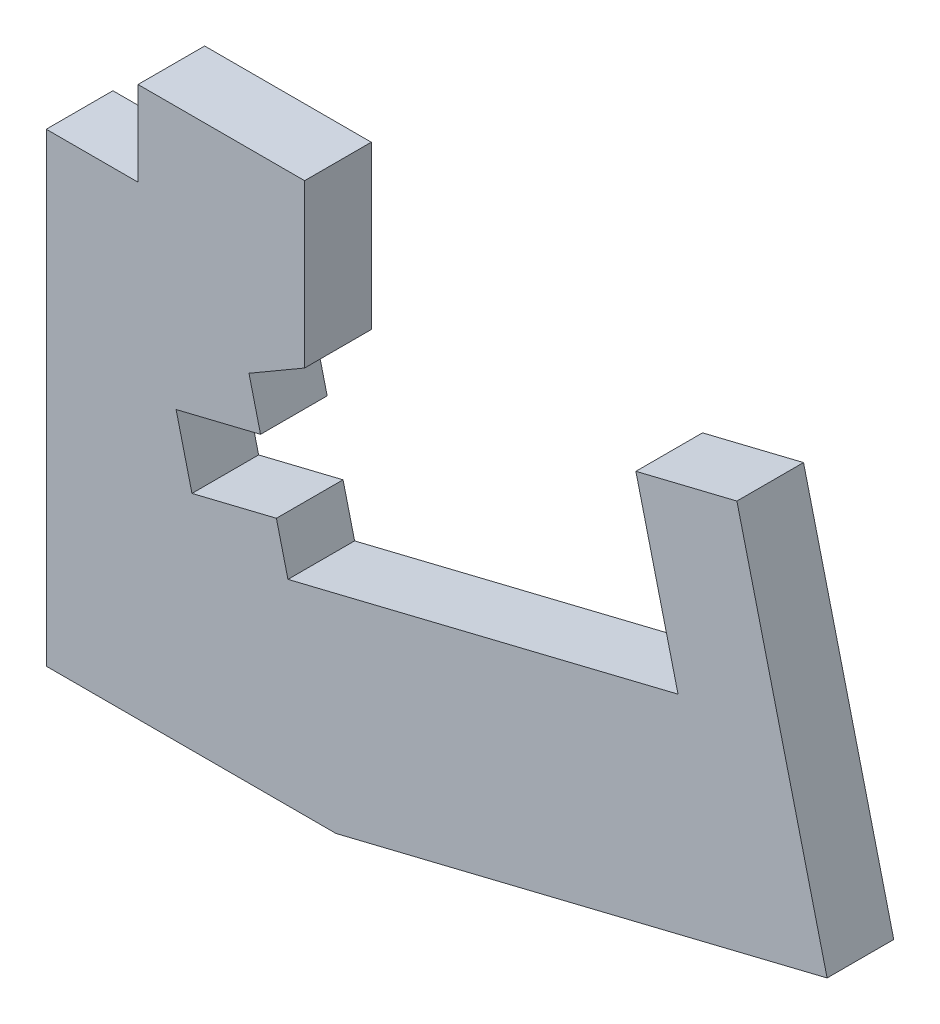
ISO-10303-21;
HEADER;
FILE_DESCRIPTION(('STEP AP214'),'2;1');
FILE_NAME('part.step','',(''),(''),'','','');
FILE_SCHEMA(('AUTOMOTIVE_DESIGN { 1 0 10303 214 1 1 1 1 }'));
ENDSEC;
DATA;
#1=APPLICATION_CONTEXT('core data for automotive mechanical design processes');
#2=APPLICATION_PROTOCOL_DEFINITION('international standard','automotive_design',2000,#1);
#3=PRODUCT_CONTEXT('',#1,'mechanical');
#4=PRODUCT('Part','Part','',(#3));
#5=PRODUCT_RELATED_PRODUCT_CATEGORY('part','',(#4));
#6=PRODUCT_DEFINITION_FORMATION('','',#4);
#7=PRODUCT_DEFINITION_CONTEXT('part definition',#1,'design');
#8=PRODUCT_DEFINITION('design','',#6,#7);
#9=PRODUCT_DEFINITION_SHAPE('','',#8);
#10=(LENGTH_UNIT() NAMED_UNIT(*) SI_UNIT(.MILLI.,.METRE.));
#11=(NAMED_UNIT(*) PLANE_ANGLE_UNIT() SI_UNIT($,.RADIAN.));
#12=(NAMED_UNIT(*) SI_UNIT($,.STERADIAN.) SOLID_ANGLE_UNIT());
#13=UNCERTAINTY_MEASURE_WITH_UNIT(LENGTH_MEASURE(1.E-05),#10,'distance_accuracy_value','');
#14=(GEOMETRIC_REPRESENTATION_CONTEXT(3) GLOBAL_UNCERTAINTY_ASSIGNED_CONTEXT((#13)) GLOBAL_UNIT_ASSIGNED_CONTEXT((#10,
#11,#12)) REPRESENTATION_CONTEXT('',''));
#15=CARTESIAN_POINT('',(0.,0.,0.));
#16=DIRECTION('',(0.,0.,1.));
#17=DIRECTION('',(1.,0.,0.));
#18=AXIS2_PLACEMENT_3D('',#15,#16,#17);
#19=CARTESIAN_POINT('',(8.0438013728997,40.764501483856,5.842));
#20=DIRECTION('',(0.,-1.,0.));
#21=DIRECTION('',(0.,0.,-1.));
#22=AXIS2_PLACEMENT_3D('',#19,#20,#21);
#23=PLANE('',#22);
#24=DIRECTION('',(-1.,0.,0.));
#25=VECTOR('',#24,1.);
#26=CARTESIAN_POINT('',(8.0438013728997,40.764501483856,0.));
#27=LINE('',#26,#25);
#28=CARTESIAN_POINT('',(8.0438013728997,40.764501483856,0.));
#29=VERTEX_POINT('',#28);
#30=CARTESIAN_POINT('',(0.,40.764501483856,0.));
#31=VERTEX_POINT('',#30);
#32=EDGE_CURVE('E153',#29,#31,#27,.T.);
#33=ORIENTED_EDGE('',*,*,#32,.T.);
#34=DIRECTION('',(0.,0.,-1.));
#35=VECTOR('',#34,1.);
#36=CARTESIAN_POINT('',(0.,40.764501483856,5.842));
#37=LINE('',#36,#35);
#38=CARTESIAN_POINT('',(0.,40.764501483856,5.842));
#39=VERTEX_POINT('',#38);
#40=EDGE_CURVE('E11',#39,#31,#37,.T.);
#41=ORIENTED_EDGE('',*,*,#40,.F.);
#42=DIRECTION('',(-1.,0.,0.));
#43=VECTOR('',#42,1.);
#44=CARTESIAN_POINT('',(8.0438013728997,40.764501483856,5.842));
#45=LINE('',#44,#43);
#46=CARTESIAN_POINT('',(8.0438013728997,40.764501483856,5.842));
#47=VERTEX_POINT('',#46);
#48=EDGE_CURVE('E198',#47,#39,#45,.T.);
#49=ORIENTED_EDGE('',*,*,#48,.F.);
#50=DIRECTION('',(0.,0.,-1.));
#51=VECTOR('',#50,1.);
#52=CARTESIAN_POINT('',(8.0438013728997,40.764501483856,5.842));
#53=LINE('',#52,#51);
#54=EDGE_CURVE('E166',#47,#29,#53,.T.);
#55=ORIENTED_EDGE('',*,*,#54,.T.);
#56=EDGE_LOOP('',(#33,#41,#49,#55));
#57=FACE_BOUND('',#56,.T.);
#58=ADVANCED_FACE('F31',(#57),#23,.F.);
#59=CARTESIAN_POINT('',(0.,40.764501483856,5.842));
#60=DIRECTION('',(1.,0.,0.));
#61=DIRECTION('',(0.,0.,-1.));
#62=AXIS2_PLACEMENT_3D('',#59,#60,#61);
#63=PLANE('',#62);
#64=DIRECTION('',(0.,-1.,0.));
#65=VECTOR('',#64,1.);
#66=CARTESIAN_POINT('',(0.,40.764501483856,0.));
#67=LINE('',#66,#65);
#68=CARTESIAN_POINT('',(0.,0.,0.));
#69=VERTEX_POINT('',#68);
#70=EDGE_CURVE('E149',#31,#69,#67,.T.);
#71=ORIENTED_EDGE('',*,*,#70,.T.);
#72=DIRECTION('',(0.,0.,-1.));
#73=VECTOR('',#72,1.);
#74=CARTESIAN_POINT('',(0.,0.,5.842));
#75=LINE('',#74,#73);
#76=CARTESIAN_POINT('',(0.,0.,5.842));
#77=VERTEX_POINT('',#76);
#78=EDGE_CURVE('E38',#77,#69,#75,.T.);
#79=ORIENTED_EDGE('',*,*,#78,.F.);
#80=DIRECTION('',(0.,-1.,0.));
#81=VECTOR('',#80,1.);
#82=CARTESIAN_POINT('',(0.,40.764501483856,5.842));
#83=LINE('',#82,#81);
#84=EDGE_CURVE('E162',#39,#77,#83,.T.);
#85=ORIENTED_EDGE('',*,*,#84,.F.);
#86=ORIENTED_EDGE('',*,*,#40,.T.);
#87=EDGE_LOOP('',(#71,#79,#85,#86));
#88=FACE_BOUND('',#87,.T.);
#89=ADVANCED_FACE('F161',(#88),#63,.F.);
#90=CARTESIAN_POINT('',(0.,0.,5.842));
#91=DIRECTION('',(0.,1.,0.));
#92=DIRECTION('',(0.,0.,1.));
#93=AXIS2_PLACEMENT_3D('',#90,#91,#92);
#94=PLANE('',#93);
#95=DIRECTION('',(1.,0.,0.));
#96=VECTOR('',#95,1.);
#97=CARTESIAN_POINT('',(0.,0.,0.));
#98=LINE('',#97,#96);
#99=CARTESIAN_POINT('',(25.4,0.,0.));
#100=VERTEX_POINT('',#99);
#101=EDGE_CURVE('E155',#69,#100,#98,.T.);
#102=ORIENTED_EDGE('',*,*,#101,.T.);
#103=DIRECTION('',(0.,0.,-1.));
#104=VECTOR('',#103,1.);
#105=CARTESIAN_POINT('',(25.4,0.,5.842));
#106=LINE('',#105,#104);
#107=CARTESIAN_POINT('',(25.4,0.,5.842));
#108=VERTEX_POINT('',#107);
#109=EDGE_CURVE('E269',#108,#100,#106,.T.);
#110=ORIENTED_EDGE('',*,*,#109,.F.);
#111=DIRECTION('',(1.,0.,0.));
#112=VECTOR('',#111,1.);
#113=CARTESIAN_POINT('',(0.,0.,5.842));
#114=LINE('',#113,#112);
#115=EDGE_CURVE('E201',#77,#108,#114,.T.);
#116=ORIENTED_EDGE('',*,*,#115,.F.);
#117=ORIENTED_EDGE('',*,*,#78,.T.);
#118=EDGE_LOOP('',(#102,#110,#116,#117));
#119=FACE_BOUND('',#118,.T.);
#120=ADVANCED_FACE('F273',(#119),#94,.F.);
#121=CARTESIAN_POINT('',(25.4,0.,5.842));
#122=DIRECTION('',(-0.238109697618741,0.971238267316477,0.));
#123=DIRECTION('',(-0.971238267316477,-0.238109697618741,0.));
#124=AXIS2_PLACEMENT_3D('',#121,#122,#123);
#125=PLANE('',#124);
#126=DIRECTION('',(0.971238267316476,0.238109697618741,0.));
#127=VECTOR('',#126,1.);
#128=CARTESIAN_POINT('',(25.4,0.,0.));
#129=LINE('',#128,#127);
#130=CARTESIAN_POINT('',(68.446907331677,10.5534207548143,0.));
#131=VERTEX_POINT('',#130);
#132=EDGE_CURVE('E170',#100,#131,#129,.T.);
#133=ORIENTED_EDGE('',*,*,#132,.T.);
#134=DIRECTION('',(0.,0.,-1.));
#135=VECTOR('',#134,1.);
#136=CARTESIAN_POINT('',(68.446907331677,10.5534207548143,5.842));
#137=LINE('',#136,#135);
#138=CARTESIAN_POINT('',(68.446907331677,10.5534207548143,5.842));
#139=VERTEX_POINT('',#138);
#140=EDGE_CURVE('E266',#139,#131,#137,.T.);
#141=ORIENTED_EDGE('',*,*,#140,.F.);
#142=DIRECTION('',(0.971238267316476,0.238109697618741,0.));
#143=VECTOR('',#142,1.);
#144=CARTESIAN_POINT('',(25.4,0.,5.842));
#145=LINE('',#144,#143);
#146=EDGE_CURVE('E203',#108,#139,#145,.T.);
#147=ORIENTED_EDGE('',*,*,#146,.F.);
#148=ORIENTED_EDGE('',*,*,#109,.T.);
#149=EDGE_LOOP('',(#133,#141,#147,#148));
#150=FACE_BOUND('',#149,.T.);
#151=ADVANCED_FACE('F281',(#150),#125,.F.);
#152=CARTESIAN_POINT('',(68.446907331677,10.5534207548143,5.842));
#153=DIRECTION('',(-0.971238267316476,-0.238109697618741,0.));
#154=DIRECTION('',(0.238109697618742,-0.971238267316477,0.));
#155=AXIS2_PLACEMENT_3D('',#152,#153,#154);
#156=PLANE('',#155);
#157=DIRECTION('',(-0.238109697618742,0.971238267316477,0.));
#158=VECTOR('',#157,1.);
#159=CARTESIAN_POINT('',(68.446907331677,10.5534207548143,0.));
#160=LINE('',#159,#158);
#161=CARTESIAN_POINT('',(60.5393817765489,42.8078459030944,0.));
#162=VERTEX_POINT('',#161);
#163=EDGE_CURVE('E172',#131,#162,#160,.T.);
#164=ORIENTED_EDGE('',*,*,#163,.T.);
#165=DIRECTION('',(0.,0.,-1.));
#166=VECTOR('',#165,1.);
#167=CARTESIAN_POINT('',(60.5393817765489,42.8078459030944,5.842));
#168=LINE('',#167,#166);
#169=CARTESIAN_POINT('',(60.5393817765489,42.8078459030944,5.842));
#170=VERTEX_POINT('',#169);
#171=EDGE_CURVE('E263',#170,#162,#168,.T.);
#172=ORIENTED_EDGE('',*,*,#171,.F.);
#173=DIRECTION('',(-0.238109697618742,0.971238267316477,0.));
#174=VECTOR('',#173,1.);
#175=CARTESIAN_POINT('',(68.446907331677,10.5534207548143,5.842));
#176=LINE('',#175,#174);
#177=EDGE_CURVE('E205',#139,#170,#176,.T.);
#178=ORIENTED_EDGE('',*,*,#177,.F.);
#179=ORIENTED_EDGE('',*,*,#140,.T.);
#180=EDGE_LOOP('',(#164,#172,#178,#179));
#181=FACE_BOUND('',#180,.T.);
#182=ADVANCED_FACE('F284',(#181),#156,.F.);
#183=CARTESIAN_POINT('',(60.5393817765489,42.8078459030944,5.842));
#184=DIRECTION('',(0.238109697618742,-0.971238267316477,0.));
#185=DIRECTION('',(0.971238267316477,0.238109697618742,0.));
#186=AXIS2_PLACEMENT_3D('',#183,#184,#185);
#187=PLANE('',#186);
#188=DIRECTION('',(-0.971238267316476,-0.238109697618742,0.));
#189=VECTOR('',#188,1.);
#190=CARTESIAN_POINT('',(60.5393817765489,42.8078459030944,0.));
#191=LINE('',#190,#189);
#192=CARTESIAN_POINT('',(51.6843349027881,40.6369341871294,0.));
#193=VERTEX_POINT('',#192);
#194=EDGE_CURVE('E174',#162,#193,#191,.T.);
#195=ORIENTED_EDGE('',*,*,#194,.T.);
#196=DIRECTION('',(0.,0.,-1.));
#197=VECTOR('',#196,1.);
#198=CARTESIAN_POINT('',(51.6843349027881,40.6369341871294,5.842));
#199=LINE('',#198,#197);
#200=CARTESIAN_POINT('',(51.6843349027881,40.6369341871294,5.842));
#201=VERTEX_POINT('',#200);
#202=EDGE_CURVE('E260',#201,#193,#199,.T.);
#203=ORIENTED_EDGE('',*,*,#202,.F.);
#204=DIRECTION('',(-0.971238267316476,-0.238109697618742,0.));
#205=VECTOR('',#204,1.);
#206=CARTESIAN_POINT('',(60.5393817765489,42.8078459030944,5.842));
#207=LINE('',#206,#205);
#208=EDGE_CURVE('E207',#170,#201,#207,.T.);
#209=ORIENTED_EDGE('',*,*,#208,.F.);
#210=ORIENTED_EDGE('',*,*,#171,.T.);
#211=EDGE_LOOP('',(#195,#203,#209,#210));
#212=FACE_BOUND('',#211,.T.);
#213=ADVANCED_FACE('F289',(#212),#187,.F.);
#214=CARTESIAN_POINT('',(51.6843349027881,40.6369341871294,5.842));
#215=DIRECTION('',(0.971238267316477,0.238109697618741,0.));
#216=DIRECTION('',(-0.238109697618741,0.971238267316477,0.));
#217=AXIS2_PLACEMENT_3D('',#214,#215,#216);
#218=PLANE('',#217);
#219=DIRECTION('',(0.238109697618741,-0.971238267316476,0.));
#220=VECTOR('',#219,1.);
#221=CARTESIAN_POINT('',(51.6843349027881,40.6369341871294,0.));
#222=LINE('',#221,#220);
#223=CARTESIAN_POINT('',(55.3787556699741,25.5675654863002,0.));
#224=VERTEX_POINT('',#223);
#225=EDGE_CURVE('E176',#193,#224,#222,.T.);
#226=ORIENTED_EDGE('',*,*,#225,.T.);
#227=DIRECTION('',(0.,0.,-1.));
#228=VECTOR('',#227,1.);
#229=CARTESIAN_POINT('',(55.3787556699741,25.5675654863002,5.842));
#230=LINE('',#229,#228);
#231=CARTESIAN_POINT('',(55.3787556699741,25.5675654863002,5.842));
#232=VERTEX_POINT('',#231);
#233=EDGE_CURVE('E257',#232,#224,#230,.T.);
#234=ORIENTED_EDGE('',*,*,#233,.F.);
#235=DIRECTION('',(0.238109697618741,-0.971238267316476,0.));
#236=VECTOR('',#235,1.);
#237=CARTESIAN_POINT('',(51.6843349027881,40.6369341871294,5.842));
#238=LINE('',#237,#236);
#239=EDGE_CURVE('E209',#201,#232,#238,.T.);
#240=ORIENTED_EDGE('',*,*,#239,.F.);
#241=ORIENTED_EDGE('',*,*,#202,.T.);
#242=EDGE_LOOP('',(#226,#234,#240,#241));
#243=FACE_BOUND('',#242,.T.);
#244=ADVANCED_FACE('F295',(#243),#218,.F.);
#245=CARTESIAN_POINT('',(21.186895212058,17.185056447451,5.842));
#246=DIRECTION('',(0.238109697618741,-0.971238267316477,0.));
#247=DIRECTION('',(0.971238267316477,0.238109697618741,0.));
#248=AXIS2_PLACEMENT_3D('',#245,#246,#247);
#249=PLANE('',#248);
#250=DIRECTION('',(-0.971238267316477,-0.238109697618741,0.));
#251=VECTOR('',#250,1.);
#252=CARTESIAN_POINT('',(21.186895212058,17.185056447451,0.));
#253=LINE('',#252,#251);
#254=CARTESIAN_POINT('',(21.186895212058,17.185056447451,0.));
#255=VERTEX_POINT('',#254);
#256=EDGE_CURVE('E178',#224,#255,#253,.T.);
#257=ORIENTED_EDGE('',*,*,#256,.T.);
#258=DIRECTION('',(0.,0.,-1.));
#259=VECTOR('',#258,1.);
#260=CARTESIAN_POINT('',(21.186895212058,17.185056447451,5.842));
#261=LINE('',#260,#259);
#262=CARTESIAN_POINT('',(21.186895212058,17.185056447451,5.842));
#263=VERTEX_POINT('',#262);
#264=EDGE_CURVE('E254',#263,#255,#261,.T.);
#265=ORIENTED_EDGE('',*,*,#264,.F.);
#266=DIRECTION('',(-0.971238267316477,-0.238109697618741,0.));
#267=VECTOR('',#266,1.);
#268=CARTESIAN_POINT('',(21.186895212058,17.185056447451,5.842));
#269=LINE('',#268,#267);
#270=EDGE_CURVE('E211',#232,#263,#269,.T.);
#271=ORIENTED_EDGE('',*,*,#270,.F.);
#272=ORIENTED_EDGE('',*,*,#233,.T.);
#273=EDGE_LOOP('',(#257,#265,#271,#272));
#274=FACE_BOUND('',#273,.T.);
#275=ADVANCED_FACE('F299',(#274),#249,.F.);
#276=CARTESIAN_POINT('',(20.173857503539,21.3171896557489,5.842));
#277=DIRECTION('',(-0.971238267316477,-0.23810969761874,0.));
#278=DIRECTION('',(0.23810969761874,-0.971238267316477,0.));
#279=AXIS2_PLACEMENT_3D('',#276,#277,#278);
#280=PLANE('',#279);
#281=DIRECTION('',(-0.23810969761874,0.971238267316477,0.));
#282=VECTOR('',#281,1.);
#283=CARTESIAN_POINT('',(20.173857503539,21.3171896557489,0.));
#284=LINE('',#283,#282);
#285=CARTESIAN_POINT('',(20.173857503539,21.3171896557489,0.));
#286=VERTEX_POINT('',#285);
#287=EDGE_CURVE('E180',#255,#286,#284,.T.);
#288=ORIENTED_EDGE('',*,*,#287,.T.);
#289=DIRECTION('',(0.,0.,-1.));
#290=VECTOR('',#289,1.);
#291=CARTESIAN_POINT('',(20.173857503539,21.3171896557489,5.842));
#292=LINE('',#291,#290);
#293=CARTESIAN_POINT('',(20.173857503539,21.3171896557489,5.842));
#294=VERTEX_POINT('',#293);
#295=EDGE_CURVE('E251',#294,#286,#292,.T.);
#296=ORIENTED_EDGE('',*,*,#295,.F.);
#297=DIRECTION('',(-0.23810969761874,0.971238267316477,0.));
#298=VECTOR('',#297,1.);
#299=CARTESIAN_POINT('',(20.173857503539,21.3171896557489,5.842));
#300=LINE('',#299,#298);
#301=EDGE_CURVE('E213',#263,#294,#300,.T.);
#302=ORIENTED_EDGE('',*,*,#301,.F.);
#303=ORIENTED_EDGE('',*,*,#264,.T.);
#304=EDGE_LOOP('',(#288,#296,#302,#303));
#305=FACE_BOUND('',#304,.T.);
#306=ADVANCED_FACE('F304',(#305),#280,.F.);
#307=CARTESIAN_POINT('',(12.7730219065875,19.5027937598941,5.842));
#308=DIRECTION('',(0.238109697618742,-0.971238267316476,0.));
#309=DIRECTION('',(0.971238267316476,0.238109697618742,0.));
#310=AXIS2_PLACEMENT_3D('',#307,#308,#309);
#311=PLANE('',#310);
#312=DIRECTION('',(-0.971238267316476,-0.238109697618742,0.));
#313=VECTOR('',#312,1.);
#314=CARTESIAN_POINT('',(12.7730219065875,19.5027937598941,0.));
#315=LINE('',#314,#313);
#316=CARTESIAN_POINT('',(12.7730219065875,19.5027937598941,0.));
#317=VERTEX_POINT('',#316);
#318=EDGE_CURVE('E182',#286,#317,#315,.T.);
#319=ORIENTED_EDGE('',*,*,#318,.T.);
#320=DIRECTION('',(0.,0.,-1.));
#321=VECTOR('',#320,1.);
#322=CARTESIAN_POINT('',(12.7730219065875,19.5027937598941,5.842));
#323=LINE('',#322,#321);
#324=CARTESIAN_POINT('',(12.7730219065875,19.5027937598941,5.842));
#325=VERTEX_POINT('',#324);
#326=EDGE_CURVE('E248',#325,#317,#323,.T.);
#327=ORIENTED_EDGE('',*,*,#326,.F.);
#328=DIRECTION('',(-0.971238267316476,-0.238109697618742,0.));
#329=VECTOR('',#328,1.);
#330=CARTESIAN_POINT('',(12.7730219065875,19.5027937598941,5.842));
#331=LINE('',#330,#329);
#332=EDGE_CURVE('E215',#294,#325,#331,.T.);
#333=ORIENTED_EDGE('',*,*,#332,.F.);
#334=ORIENTED_EDGE('',*,*,#295,.T.);
#335=EDGE_LOOP('',(#319,#327,#333,#334));
#336=FACE_BOUND('',#335,.T.);
#337=ADVANCED_FACE('F310',(#336),#311,.F.);
#338=CARTESIAN_POINT('',(11.3819850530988,25.176767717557,5.842));
#339=DIRECTION('',(-0.971238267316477,-0.238109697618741,0.));
#340=DIRECTION('',(0.238109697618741,-0.971238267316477,0.));
#341=AXIS2_PLACEMENT_3D('',#338,#339,#340);
#342=PLANE('',#341);
#343=DIRECTION('',(-0.238109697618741,0.971238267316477,0.));
#344=VECTOR('',#343,1.);
#345=CARTESIAN_POINT('',(11.3819850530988,25.176767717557,0.));
#346=LINE('',#345,#344);
#347=CARTESIAN_POINT('',(11.3819850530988,25.176767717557,0.));
#348=VERTEX_POINT('',#347);
#349=EDGE_CURVE('E184',#317,#348,#346,.T.);
#350=ORIENTED_EDGE('',*,*,#349,.T.);
#351=DIRECTION('',(0.,0.,-1.));
#352=VECTOR('',#351,1.);
#353=CARTESIAN_POINT('',(11.3819850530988,25.176767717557,5.842));
#354=LINE('',#353,#352);
#355=CARTESIAN_POINT('',(11.3819850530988,25.176767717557,5.842));
#356=VERTEX_POINT('',#355);
#357=EDGE_CURVE('E245',#356,#348,#354,.T.);
#358=ORIENTED_EDGE('',*,*,#357,.F.);
#359=DIRECTION('',(-0.238109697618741,0.971238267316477,0.));
#360=VECTOR('',#359,1.);
#361=CARTESIAN_POINT('',(11.3819850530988,25.176767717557,5.842));
#362=LINE('',#361,#360);
#363=EDGE_CURVE('E217',#325,#356,#362,.T.);
#364=ORIENTED_EDGE('',*,*,#363,.F.);
#365=ORIENTED_EDGE('',*,*,#326,.T.);
#366=EDGE_LOOP('',(#350,#358,#364,#365));
#367=FACE_BOUND('',#366,.T.);
#368=ADVANCED_FACE('F314',(#367),#342,.F.);
#369=CARTESIAN_POINT('',(18.7828206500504,26.9911636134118,5.842));
#370=DIRECTION('',(-0.238109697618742,0.971238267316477,0.));
#371=DIRECTION('',(-0.971238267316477,-0.238109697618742,0.));
#372=AXIS2_PLACEMENT_3D('',#369,#370,#371);
#373=PLANE('',#372);
#374=DIRECTION('',(0.971238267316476,0.238109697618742,0.));
#375=VECTOR('',#374,1.);
#376=CARTESIAN_POINT('',(18.7828206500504,26.9911636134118,0.));
#377=LINE('',#376,#375);
#378=CARTESIAN_POINT('',(18.7828206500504,26.9911636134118,0.));
#379=VERTEX_POINT('',#378);
#380=EDGE_CURVE('E186',#348,#379,#377,.T.);
#381=ORIENTED_EDGE('',*,*,#380,.T.);
#382=DIRECTION('',(0.,0.,-1.));
#383=VECTOR('',#382,1.);
#384=CARTESIAN_POINT('',(18.7828206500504,26.9911636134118,5.842));
#385=LINE('',#384,#383);
#386=CARTESIAN_POINT('',(18.7828206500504,26.9911636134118,5.842));
#387=VERTEX_POINT('',#386);
#388=EDGE_CURVE('E242',#387,#379,#385,.T.);
#389=ORIENTED_EDGE('',*,*,#388,.F.);
#390=DIRECTION('',(0.971238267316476,0.238109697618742,0.));
#391=VECTOR('',#390,1.);
#392=CARTESIAN_POINT('',(18.7828206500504,26.9911636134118,5.842));
#393=LINE('',#392,#391);
#394=EDGE_CURVE('E219',#356,#387,#393,.T.);
#395=ORIENTED_EDGE('',*,*,#394,.F.);
#396=ORIENTED_EDGE('',*,*,#357,.T.);
#397=EDGE_LOOP('',(#381,#389,#395,#396));
#398=FACE_BOUND('',#397,.T.);
#399=ADVANCED_FACE('F319',(#398),#373,.F.);
#400=CARTESIAN_POINT('',(17.7697829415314,31.1232968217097,5.842));
#401=DIRECTION('',(-0.971238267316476,-0.238109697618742,0.));
#402=DIRECTION('',(0.238109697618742,-0.971238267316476,0.));
#403=AXIS2_PLACEMENT_3D('',#400,#401,#402);
#404=PLANE('',#403);
#405=DIRECTION('',(-0.238109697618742,0.971238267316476,0.));
#406=VECTOR('',#405,1.);
#407=CARTESIAN_POINT('',(17.7697829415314,31.1232968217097,0.));
#408=LINE('',#407,#406);
#409=CARTESIAN_POINT('',(17.7697829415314,31.1232968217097,0.));
#410=VERTEX_POINT('',#409);
#411=EDGE_CURVE('E188',#379,#410,#408,.T.);
#412=ORIENTED_EDGE('',*,*,#411,.T.);
#413=DIRECTION('',(0.,0.,-1.));
#414=VECTOR('',#413,1.);
#415=CARTESIAN_POINT('',(17.7697829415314,31.1232968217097,5.842));
#416=LINE('',#415,#414);
#417=CARTESIAN_POINT('',(17.7697829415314,31.1232968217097,5.842));
#418=VERTEX_POINT('',#417);
#419=EDGE_CURVE('E239',#418,#410,#416,.T.);
#420=ORIENTED_EDGE('',*,*,#419,.F.);
#421=DIRECTION('',(-0.238109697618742,0.971238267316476,0.));
#422=VECTOR('',#421,1.);
#423=CARTESIAN_POINT('',(17.7697829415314,31.1232968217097,5.842));
#424=LINE('',#423,#422);
#425=EDGE_CURVE('E221',#387,#418,#424,.T.);
#426=ORIENTED_EDGE('',*,*,#425,.F.);
#427=ORIENTED_EDGE('',*,*,#388,.T.);
#428=EDGE_LOOP('',(#412,#420,#426,#427));
#429=FACE_BOUND('',#428,.T.);
#430=ADVANCED_FACE('F325',(#429),#404,.F.);
#431=CARTESIAN_POINT('',(17.7697829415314,31.1232968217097,5.842));
#432=DIRECTION('',(-0.502642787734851,0.864494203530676,0.));
#433=DIRECTION('',(-0.864494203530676,-0.502642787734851,0.));
#434=AXIS2_PLACEMENT_3D('',#431,#432,#433);
#435=PLANE('',#434);
#436=DIRECTION('',(0.864494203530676,0.502642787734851,0.));
#437=VECTOR('',#436,1.);
#438=CARTESIAN_POINT('',(17.7697829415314,31.1232968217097,0.));
#439=LINE('',#438,#437);
#440=CARTESIAN_POINT('',(22.6479295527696,33.9595971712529,0.));
#441=VERTEX_POINT('',#440);
#442=EDGE_CURVE('E190',#410,#441,#439,.T.);
#443=ORIENTED_EDGE('',*,*,#442,.T.);
#444=DIRECTION('',(0.,0.,-1.));
#445=VECTOR('',#444,1.);
#446=CARTESIAN_POINT('',(22.6479295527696,33.9595971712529,5.842));
#447=LINE('',#446,#445);
#448=CARTESIAN_POINT('',(22.6479295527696,33.9595971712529,5.842));
#449=VERTEX_POINT('',#448);
#450=EDGE_CURVE('E236',#449,#441,#447,.T.);
#451=ORIENTED_EDGE('',*,*,#450,.F.);
#452=DIRECTION('',(0.864494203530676,0.502642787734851,0.));
#453=VECTOR('',#452,1.);
#454=CARTESIAN_POINT('',(17.7697829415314,31.1232968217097,5.842));
#455=LINE('',#454,#453);
#456=EDGE_CURVE('E223',#418,#449,#455,.T.);
#457=ORIENTED_EDGE('',*,*,#456,.F.);
#458=ORIENTED_EDGE('',*,*,#419,.T.);
#459=EDGE_LOOP('',(#443,#451,#457,#458));
#460=FACE_BOUND('',#459,.T.);
#461=ADVANCED_FACE('F329',(#460),#435,.F.);
#462=CARTESIAN_POINT('',(22.6479295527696,33.9595971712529,5.842));
#463=DIRECTION('',(-1.,0.,0.));
#464=DIRECTION('',(0.,0.,1.));
#465=AXIS2_PLACEMENT_3D('',#462,#463,#464);
#466=PLANE('',#465);
#467=DIRECTION('',(0.,1.,0.));
#468=VECTOR('',#467,1.);
#469=CARTESIAN_POINT('',(22.6479295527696,33.9595971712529,0.));
#470=LINE('',#469,#468);
#471=CARTESIAN_POINT('',(22.6479295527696,48.1820045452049,0.));
#472=VERTEX_POINT('',#471);
#473=EDGE_CURVE('E192',#441,#472,#470,.T.);
#474=ORIENTED_EDGE('',*,*,#473,.T.);
#475=DIRECTION('',(0.,0.,-1.));
#476=VECTOR('',#475,1.);
#477=CARTESIAN_POINT('',(22.6479295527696,48.1820045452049,5.842));
#478=LINE('',#477,#476);
#479=CARTESIAN_POINT('',(22.6479295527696,48.1820045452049,5.842));
#480=VERTEX_POINT('',#479);
#481=EDGE_CURVE('E233',#480,#472,#478,.T.);
#482=ORIENTED_EDGE('',*,*,#481,.F.);
#483=DIRECTION('',(0.,1.,0.));
#484=VECTOR('',#483,1.);
#485=CARTESIAN_POINT('',(22.6479295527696,33.9595971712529,5.842));
#486=LINE('',#485,#484);
#487=EDGE_CURVE('E225',#449,#480,#486,.T.);
#488=ORIENTED_EDGE('',*,*,#487,.F.);
#489=ORIENTED_EDGE('',*,*,#450,.T.);
#490=EDGE_LOOP('',(#474,#482,#488,#489));
#491=FACE_BOUND('',#490,.T.);
#492=ADVANCED_FACE('F334',(#491),#466,.F.);
#493=CARTESIAN_POINT('',(22.6479295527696,48.1820045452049,5.842));
#494=DIRECTION('',(0.,-1.,0.));
#495=DIRECTION('',(0.,0.,-1.));
#496=AXIS2_PLACEMENT_3D('',#493,#494,#495);
#497=PLANE('',#496);
#498=DIRECTION('',(-1.,0.,0.));
#499=VECTOR('',#498,1.);
#500=CARTESIAN_POINT('',(22.6479295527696,48.1820045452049,0.));
#501=LINE('',#500,#499);
#502=CARTESIAN_POINT('',(8.0438013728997,48.1820045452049,0.));
#503=VERTEX_POINT('',#502);
#504=EDGE_CURVE('E194',#472,#503,#501,.T.);
#505=ORIENTED_EDGE('',*,*,#504,.T.);
#506=DIRECTION('',(0.,0.,-1.));
#507=VECTOR('',#506,1.);
#508=CARTESIAN_POINT('',(8.0438013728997,48.1820045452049,5.842));
#509=LINE('',#508,#507);
#510=CARTESIAN_POINT('',(8.0438013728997,48.1820045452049,5.842));
#511=VERTEX_POINT('',#510);
#512=EDGE_CURVE('E230',#511,#503,#509,.T.);
#513=ORIENTED_EDGE('',*,*,#512,.F.);
#514=DIRECTION('',(-1.,0.,0.));
#515=VECTOR('',#514,1.);
#516=CARTESIAN_POINT('',(22.6479295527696,48.1820045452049,5.842));
#517=LINE('',#516,#515);
#518=EDGE_CURVE('E50',#480,#511,#517,.T.);
#519=ORIENTED_EDGE('',*,*,#518,.F.);
#520=ORIENTED_EDGE('',*,*,#481,.T.);
#521=EDGE_LOOP('',(#505,#513,#519,#520));
#522=FACE_BOUND('',#521,.T.);
#523=ADVANCED_FACE('F337',(#522),#497,.F.);
#524=CARTESIAN_POINT('',(8.0438013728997,48.1820045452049,5.842));
#525=DIRECTION('',(1.,0.,0.));
#526=DIRECTION('',(0.,0.,-1.));
#527=AXIS2_PLACEMENT_3D('',#524,#525,#526);
#528=PLANE('',#527);
#529=DIRECTION('',(0.,-1.,0.));
#530=VECTOR('',#529,1.);
#531=CARTESIAN_POINT('',(8.0438013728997,48.1820045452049,0.));
#532=LINE('',#531,#530);
#533=EDGE_CURVE('E196',#503,#29,#532,.T.);
#534=ORIENTED_EDGE('',*,*,#533,.T.);
#535=ORIENTED_EDGE('',*,*,#54,.F.);
#536=DIRECTION('',(0.,-1.,0.));
#537=VECTOR('',#536,1.);
#538=CARTESIAN_POINT('',(8.0438013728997,48.1820045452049,5.842));
#539=LINE('',#538,#537);
#540=EDGE_CURVE('E45',#511,#47,#539,.T.);
#541=ORIENTED_EDGE('',*,*,#540,.F.);
#542=ORIENTED_EDGE('',*,*,#512,.T.);
#543=EDGE_LOOP('',(#534,#535,#541,#542));
#544=FACE_BOUND('',#543,.T.);
#545=ADVANCED_FACE('F339',(#544),#528,.F.);
#546=CARTESIAN_POINT('',(0.,40.764501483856,5.842));
#547=DIRECTION('',(0.,0.,1.));
#548=DIRECTION('',(1.,0.,0.));
#549=AXIS2_PLACEMENT_3D('',#546,#547,#548);
#550=PLANE('',#549);
#551=ORIENTED_EDGE('',*,*,#48,.T.);
#552=ORIENTED_EDGE('',*,*,#84,.T.);
#553=ORIENTED_EDGE('',*,*,#115,.T.);
#554=ORIENTED_EDGE('',*,*,#146,.T.);
#555=ORIENTED_EDGE('',*,*,#177,.T.);
#556=ORIENTED_EDGE('',*,*,#208,.T.);
#557=ORIENTED_EDGE('',*,*,#239,.T.);
#558=ORIENTED_EDGE('',*,*,#270,.T.);
#559=ORIENTED_EDGE('',*,*,#301,.T.);
#560=ORIENTED_EDGE('',*,*,#332,.T.);
#561=ORIENTED_EDGE('',*,*,#363,.T.);
#562=ORIENTED_EDGE('',*,*,#394,.T.);
#563=ORIENTED_EDGE('',*,*,#425,.T.);
#564=ORIENTED_EDGE('',*,*,#456,.T.);
#565=ORIENTED_EDGE('',*,*,#487,.T.);
#566=ORIENTED_EDGE('',*,*,#518,.T.);
#567=ORIENTED_EDGE('',*,*,#540,.T.);
#568=EDGE_LOOP('',(#551,#552,#553,#554,#555,#556,#557,#558,#559,#560,#561,#562,#563,#564,#565,
#566,#567));
#569=FACE_BOUND('',#568,.T.);
#570=ADVANCED_FACE('F276',(#569),#550,.T.);
#571=CARTESIAN_POINT('',(0.,40.764501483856,0.));
#572=DIRECTION('',(0.,0.,1.));
#573=DIRECTION('',(1.,0.,0.));
#574=AXIS2_PLACEMENT_3D('',#571,#572,#573);
#575=PLANE('',#574);
#576=ORIENTED_EDGE('',*,*,#32,.F.);
#577=ORIENTED_EDGE('',*,*,#533,.F.);
#578=ORIENTED_EDGE('',*,*,#504,.F.);
#579=ORIENTED_EDGE('',*,*,#473,.F.);
#580=ORIENTED_EDGE('',*,*,#442,.F.);
#581=ORIENTED_EDGE('',*,*,#411,.F.);
#582=ORIENTED_EDGE('',*,*,#380,.F.);
#583=ORIENTED_EDGE('',*,*,#349,.F.);
#584=ORIENTED_EDGE('',*,*,#318,.F.);
#585=ORIENTED_EDGE('',*,*,#287,.F.);
#586=ORIENTED_EDGE('',*,*,#256,.F.);
#587=ORIENTED_EDGE('',*,*,#225,.F.);
#588=ORIENTED_EDGE('',*,*,#194,.F.);
#589=ORIENTED_EDGE('',*,*,#163,.F.);
#590=ORIENTED_EDGE('',*,*,#132,.F.);
#591=ORIENTED_EDGE('',*,*,#101,.F.);
#592=ORIENTED_EDGE('',*,*,#70,.F.);
#593=EDGE_LOOP('',(#576,#577,#578,#579,#580,#581,#582,#583,#584,#585,#586,#587,#588,#589,#590,
#591,#592));
#594=FACE_BOUND('',#593,.T.);
#595=ADVANCED_FACE('F150',(#594),#575,.F.);
#596=CLOSED_SHELL('',(#58,#89,#120,#151,#182,#213,#244,#275,#306,#337,#368,#399,#430,#461,#492,
#523,#545,#570,#595));
#597=MANIFOLD_SOLID_BREP('B2',#596);
#598=ADVANCED_BREP_SHAPE_REPRESENTATION('',(#18,#597),#14);
#599=SHAPE_DEFINITION_REPRESENTATION(#9,#598);
ENDSEC;
END-ISO-10303-21;
